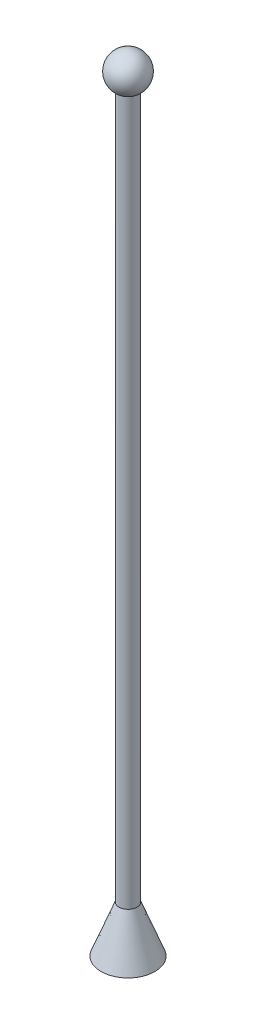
from build123d import *

# Parameters (mm, degrees)
SKETCH1_R           = 19.05
SKETCH2_R           = 6.35
SKETCH3_R           = 6.35
BOSS_EXTRUDE1_DEPTH = 508


with BuildPart() as part:
    # Sketch1 → Loft1 section 0
    with BuildSketch(Plane(origin=(0, 0, 0), x_dir=(1, 0, 0), z_dir=(0, 1, 0))):
        Circle(SKETCH1_R)
    # Sketch2 → Loft1 section 1
    with BuildSketch(Plane(origin=(0, 33.02, 0), x_dir=(-1, 0, 0), z_dir=(0, 1, 0))):
        Circle(SKETCH2_R)
    loft()

    # Sketch3 → Boss-Extrude1 (add)
    with BuildSketch(Plane(origin=(0, 33.02, 0), x_dir=(1, 0, 0), z_dir=(0, 1, 0))):
        with Locations(Location((0, 0, 0), (0, 0, 90))):
            Circle(SKETCH3_R)
    extrude(amount=BOSS_EXTRUDE1_DEPTH)

    # Sketch5 → Revolve1 (revolve)
    with BuildSketch(Plane(origin=(0, 0, 0), x_dir=(0, 0, -1), z_dir=(1, 0, 0))):
        with BuildLine():
            Line((0, 553.72), (0, 528.32))
            ThreePointArc((0, 528.32), (12.7, 541.02), (0, 553.72))
        make_face()
    revolve(axis=Axis((0, 553.72, 0), (0, -1, 0)))


solid = part.part
